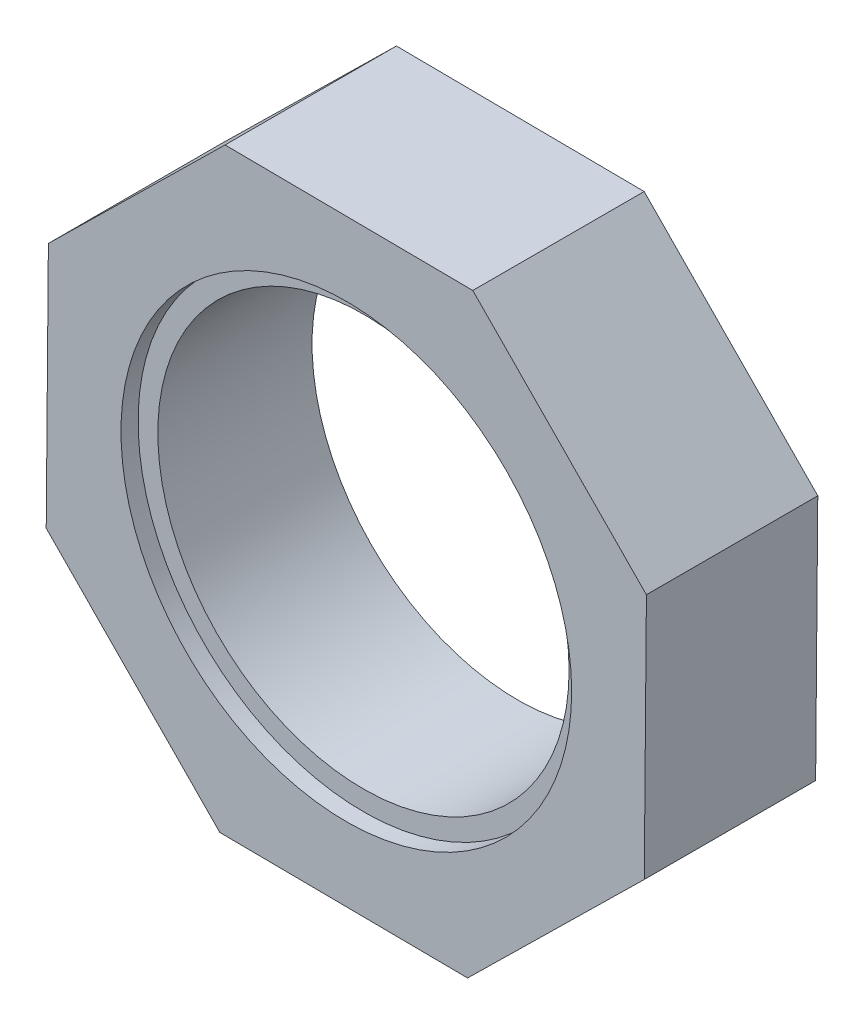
ISO-10303-21;
HEADER;
FILE_DESCRIPTION(('STEP AP214'),'2;1');
FILE_NAME('part.step','',(''),(''),'','','');
FILE_SCHEMA(('AUTOMOTIVE_DESIGN { 1 0 10303 214 1 1 1 1 }'));
ENDSEC;
DATA;
#1=APPLICATION_CONTEXT('core data for automotive mechanical design processes');
#2=APPLICATION_PROTOCOL_DEFINITION('international standard','automotive_design',2000,#1);
#3=PRODUCT_CONTEXT('',#1,'mechanical');
#4=PRODUCT('Part','Part','',(#3));
#5=PRODUCT_RELATED_PRODUCT_CATEGORY('part','',(#4));
#6=PRODUCT_DEFINITION_FORMATION('','',#4);
#7=PRODUCT_DEFINITION_CONTEXT('part definition',#1,'design');
#8=PRODUCT_DEFINITION('design','',#6,#7);
#9=PRODUCT_DEFINITION_SHAPE('','',#8);
#10=(LENGTH_UNIT() NAMED_UNIT(*) SI_UNIT(.MILLI.,.METRE.));
#11=(NAMED_UNIT(*) PLANE_ANGLE_UNIT() SI_UNIT($,.RADIAN.));
#12=(NAMED_UNIT(*) SI_UNIT($,.STERADIAN.) SOLID_ANGLE_UNIT());
#13=UNCERTAINTY_MEASURE_WITH_UNIT(LENGTH_MEASURE(1.E-05),#10,'distance_accuracy_value','');
#14=(GEOMETRIC_REPRESENTATION_CONTEXT(3) GLOBAL_UNCERTAINTY_ASSIGNED_CONTEXT((#13)) GLOBAL_UNIT_ASSIGNED_CONTEXT((#10,
#11,#12)) REPRESENTATION_CONTEXT('',''));
#15=CARTESIAN_POINT('',(0.,0.,0.));
#16=DIRECTION('',(0.,0.,1.));
#17=DIRECTION('',(1.,0.,0.));
#18=AXIS2_PLACEMENT_3D('',#15,#16,#17);
#19=CARTESIAN_POINT('',(0.,0.,0.));
#20=DIRECTION('',(0.,0.,1.));
#21=DIRECTION('',(1.,0.,0.));
#22=AXIS2_PLACEMENT_3D('',#19,#20,#21);
#23=CYLINDRICAL_SURFACE('',#22,12.);
#24=CARTESIAN_POINT('',(0.,0.,0.));
#25=DIRECTION('',(0.,0.,1.));
#26=DIRECTION('',(1.,0.,0.));
#27=AXIS2_PLACEMENT_3D('',#24,#25,#26);
#28=CIRCLE('',#27,12.);
#29=CARTESIAN_POINT('',(12.,0.,0.));
#30=VERTEX_POINT('',#29);
#31=EDGE_CURVE('E134',#30,#30,#28,.T.);
#32=ORIENTED_EDGE('',*,*,#31,.F.);
#33=EDGE_LOOP('',(#32));
#34=FACE_BOUND('',#33,.T.);
#35=CARTESIAN_POINT('',(0.,0.,9.));
#36=DIRECTION('',(0.,0.,1.));
#37=DIRECTION('',(1.,0.,0.));
#38=AXIS2_PLACEMENT_3D('',#35,#36,#37);
#39=CIRCLE('',#38,12.);
#40=CARTESIAN_POINT('',(12.,0.,9.));
#41=VERTEX_POINT('',#40);
#42=EDGE_CURVE('E36',#41,#41,#39,.F.);
#43=ORIENTED_EDGE('',*,*,#42,.F.);
#44=EDGE_LOOP('',(#43));
#45=FACE_BOUND('',#44,.T.);
#46=ADVANCED_FACE('F32',(#34,#45),#23,.F.);
#47=CARTESIAN_POINT('',(17.3862599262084,-7.38002948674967,10.));
#48=DIRECTION('',(-0.999961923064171,0.00872653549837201,0.));
#49=DIRECTION('',(-0.00872653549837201,-0.999961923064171,0.));
#50=AXIS2_PLACEMENT_3D('',#47,#48,#49);
#51=PLANE('',#50);
#52=DIRECTION('',(0.00872653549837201,0.999961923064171,0.));
#53=VECTOR('',#52,1.);
#54=CARTESIAN_POINT('',(17.3862599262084,-7.38002948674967,0.));
#55=LINE('',#54,#53);
#56=CARTESIAN_POINT('',(17.3862599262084,-7.38002948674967,0.));
#57=VERTEX_POINT('',#56);
#58=CARTESIAN_POINT('',(17.5124111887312,7.07547339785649,0.));
#59=VERTEX_POINT('',#58);
#60=EDGE_CURVE('E130',#57,#59,#55,.T.);
#61=ORIENTED_EDGE('',*,*,#60,.T.);
#62=DIRECTION('',(0.,0.,-1.));
#63=VECTOR('',#62,1.);
#64=CARTESIAN_POINT('',(17.5124111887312,7.07547339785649,10.));
#65=LINE('',#64,#63);
#66=CARTESIAN_POINT('',(17.5124111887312,7.07547339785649,10.));
#67=VERTEX_POINT('',#66);
#68=EDGE_CURVE('E11',#67,#59,#65,.T.);
#69=ORIENTED_EDGE('',*,*,#68,.F.);
#70=DIRECTION('',(0.00872653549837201,0.999961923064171,0.));
#71=VECTOR('',#70,1.);
#72=CARTESIAN_POINT('',(17.3862599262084,-7.38002948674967,10.));
#73=LINE('',#72,#71);
#74=CARTESIAN_POINT('',(17.3862599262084,-7.38002948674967,10.));
#75=VERTEX_POINT('',#74);
#76=EDGE_CURVE('E145',#75,#67,#73,.T.);
#77=ORIENTED_EDGE('',*,*,#76,.F.);
#78=DIRECTION('',(0.,0.,-1.));
#79=VECTOR('',#78,1.);
#80=CARTESIAN_POINT('',(17.3862599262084,-7.38002948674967,10.));
#81=LINE('',#80,#79);
#82=EDGE_CURVE('E126',#75,#57,#81,.T.);
#83=ORIENTED_EDGE('',*,*,#82,.T.);
#84=EDGE_LOOP('',(#61,#69,#77,#83));
#85=FACE_BOUND('',#84,.T.);
#86=ADVANCED_FACE('F34',(#85),#51,.F.);
#87=CARTESIAN_POINT('',(17.5124111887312,7.07547339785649,10.));
#88=DIRECTION('',(-0.71325044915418,-0.700909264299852,0.));
#89=DIRECTION('',(0.700909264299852,-0.71325044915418,0.));
#90=AXIS2_PLACEMENT_3D('',#87,#88,#89);
#91=PLANE('',#90);
#92=DIRECTION('',(-0.700909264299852,0.71325044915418,0.));
#93=VECTOR('',#92,1.);
#94=CARTESIAN_POINT('',(17.5124111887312,7.07547339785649,0.));
#95=LINE('',#94,#93);
#96=CARTESIAN_POINT('',(7.38002948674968,17.3862599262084,0.));
#97=VERTEX_POINT('',#96);
#98=EDGE_CURVE('E133',#59,#97,#95,.T.);
#99=ORIENTED_EDGE('',*,*,#98,.T.);
#100=DIRECTION('',(0.,0.,-1.));
#101=VECTOR('',#100,1.);
#102=CARTESIAN_POINT('',(7.38002948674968,17.3862599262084,10.));
#103=LINE('',#102,#101);
#104=CARTESIAN_POINT('',(7.38002948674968,17.3862599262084,10.));
#105=VERTEX_POINT('',#104);
#106=EDGE_CURVE('E42',#105,#97,#103,.T.);
#107=ORIENTED_EDGE('',*,*,#106,.F.);
#108=DIRECTION('',(-0.700909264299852,0.71325044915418,0.));
#109=VECTOR('',#108,1.);
#110=CARTESIAN_POINT('',(17.5124111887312,7.07547339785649,10.));
#111=LINE('',#110,#109);
#112=EDGE_CURVE('E93',#67,#105,#111,.T.);
#113=ORIENTED_EDGE('',*,*,#112,.F.);
#114=ORIENTED_EDGE('',*,*,#68,.T.);
#115=EDGE_LOOP('',(#99,#107,#113,#114));
#116=FACE_BOUND('',#115,.T.);
#117=ADVANCED_FACE('F199',(#116),#91,.F.);
#118=CARTESIAN_POINT('',(7.38002948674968,17.3862599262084,10.));
#119=DIRECTION('',(-0.00872653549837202,-0.999961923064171,0.));
#120=DIRECTION('',(0.999961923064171,-0.00872653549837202,0.));
#121=AXIS2_PLACEMENT_3D('',#118,#119,#120);
#122=PLANE('',#121);
#123=DIRECTION('',(-0.999961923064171,0.00872653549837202,0.));
#124=VECTOR('',#123,1.);
#125=CARTESIAN_POINT('',(7.38002948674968,17.3862599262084,0.));
#126=LINE('',#125,#124);
#127=CARTESIAN_POINT('',(-7.07547339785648,17.5124111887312,0.));
#128=VERTEX_POINT('',#127);
#129=EDGE_CURVE('E136',#97,#128,#126,.T.);
#130=ORIENTED_EDGE('',*,*,#129,.T.);
#131=DIRECTION('',(0.,0.,-1.));
#132=VECTOR('',#131,1.);
#133=CARTESIAN_POINT('',(-7.07547339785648,17.5124111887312,10.));
#134=LINE('',#133,#132);
#135=CARTESIAN_POINT('',(-7.07547339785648,17.5124111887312,10.));
#136=VERTEX_POINT('',#135);
#137=EDGE_CURVE('E152',#136,#128,#134,.T.);
#138=ORIENTED_EDGE('',*,*,#137,.F.);
#139=DIRECTION('',(-0.999961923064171,0.00872653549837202,0.));
#140=VECTOR('',#139,1.);
#141=CARTESIAN_POINT('',(7.38002948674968,17.3862599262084,10.));
#142=LINE('',#141,#140);
#143=EDGE_CURVE('E161',#105,#136,#142,.T.);
#144=ORIENTED_EDGE('',*,*,#143,.F.);
#145=ORIENTED_EDGE('',*,*,#106,.T.);
#146=EDGE_LOOP('',(#130,#138,#144,#145));
#147=FACE_BOUND('',#146,.T.);
#148=ADVANCED_FACE('F159',(#147),#122,.F.);
#149=CARTESIAN_POINT('',(-7.07547339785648,17.5124111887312,10.));
#150=DIRECTION('',(0.700909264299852,-0.713250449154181,0.));
#151=DIRECTION('',(0.713250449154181,0.700909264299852,0.));
#152=AXIS2_PLACEMENT_3D('',#149,#150,#151);
#153=PLANE('',#152);
#154=DIRECTION('',(-0.713250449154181,-0.700909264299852,0.));
#155=VECTOR('',#154,1.);
#156=CARTESIAN_POINT('',(-7.07547339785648,17.5124111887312,0.));
#157=LINE('',#156,#155);
#158=CARTESIAN_POINT('',(-17.3862599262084,7.38002948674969,0.));
#159=VERTEX_POINT('',#158);
#160=EDGE_CURVE('E138',#128,#159,#157,.T.);
#161=ORIENTED_EDGE('',*,*,#160,.T.);
#162=DIRECTION('',(0.,0.,-1.));
#163=VECTOR('',#162,1.);
#164=CARTESIAN_POINT('',(-17.3862599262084,7.38002948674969,10.));
#165=LINE('',#164,#163);
#166=CARTESIAN_POINT('',(-17.3862599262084,7.38002948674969,10.));
#167=VERTEX_POINT('',#166);
#168=EDGE_CURVE('E149',#167,#159,#165,.T.);
#169=ORIENTED_EDGE('',*,*,#168,.F.);
#170=DIRECTION('',(-0.713250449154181,-0.700909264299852,0.));
#171=VECTOR('',#170,1.);
#172=CARTESIAN_POINT('',(-7.07547339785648,17.5124111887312,10.));
#173=LINE('',#172,#171);
#174=EDGE_CURVE('E173',#136,#167,#173,.T.);
#175=ORIENTED_EDGE('',*,*,#174,.F.);
#176=ORIENTED_EDGE('',*,*,#137,.T.);
#177=EDGE_LOOP('',(#161,#169,#175,#176));
#178=FACE_BOUND('',#177,.T.);
#179=ADVANCED_FACE('F169',(#178),#153,.F.);
#180=CARTESIAN_POINT('',(-17.3862599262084,7.38002948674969,10.));
#181=DIRECTION('',(0.999961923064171,-0.00872653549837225,0.));
#182=DIRECTION('',(0.00872653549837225,0.999961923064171,0.));
#183=AXIS2_PLACEMENT_3D('',#180,#181,#182);
#184=PLANE('',#183);
#185=DIRECTION('',(-0.00872653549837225,-0.999961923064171,0.));
#186=VECTOR('',#185,1.);
#187=CARTESIAN_POINT('',(-17.3862599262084,7.38002948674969,0.));
#188=LINE('',#187,#186);
#189=CARTESIAN_POINT('',(-17.5124111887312,-7.07547339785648,0.));
#190=VERTEX_POINT('',#189);
#191=EDGE_CURVE('E140',#159,#190,#188,.T.);
#192=ORIENTED_EDGE('',*,*,#191,.T.);
#193=DIRECTION('',(0.,0.,-1.));
#194=VECTOR('',#193,1.);
#195=CARTESIAN_POINT('',(-17.5124111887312,-7.07547339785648,10.));
#196=LINE('',#195,#194);
#197=CARTESIAN_POINT('',(-17.5124111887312,-7.07547339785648,10.));
#198=VERTEX_POINT('',#197);
#199=EDGE_CURVE('E121',#198,#190,#196,.T.);
#200=ORIENTED_EDGE('',*,*,#199,.F.);
#201=DIRECTION('',(-0.00872653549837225,-0.999961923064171,0.));
#202=VECTOR('',#201,1.);
#203=CARTESIAN_POINT('',(-17.3862599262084,7.38002948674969,10.));
#204=LINE('',#203,#202);
#205=EDGE_CURVE('E112',#167,#198,#204,.T.);
#206=ORIENTED_EDGE('',*,*,#205,.F.);
#207=ORIENTED_EDGE('',*,*,#168,.T.);
#208=EDGE_LOOP('',(#192,#200,#206,#207));
#209=FACE_BOUND('',#208,.T.);
#210=ADVANCED_FACE('F172',(#209),#184,.F.);
#211=CARTESIAN_POINT('',(-17.5124111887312,-7.07547339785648,10.));
#212=DIRECTION('',(0.713250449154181,0.700909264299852,0.));
#213=DIRECTION('',(-0.700909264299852,0.713250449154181,0.));
#214=AXIS2_PLACEMENT_3D('',#211,#212,#213);
#215=PLANE('',#214);
#216=DIRECTION('',(0.700909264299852,-0.713250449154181,0.));
#217=VECTOR('',#216,1.);
#218=CARTESIAN_POINT('',(-17.5124111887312,-7.07547339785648,0.));
#219=LINE('',#218,#217);
#220=CARTESIAN_POINT('',(-7.38002948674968,-17.3862599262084,0.));
#221=VERTEX_POINT('',#220);
#222=EDGE_CURVE('E120',#190,#221,#219,.T.);
#223=ORIENTED_EDGE('',*,*,#222,.T.);
#224=DIRECTION('',(0.,0.,-1.));
#225=VECTOR('',#224,1.);
#226=CARTESIAN_POINT('',(-7.38002948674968,-17.3862599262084,10.));
#227=LINE('',#226,#225);
#228=CARTESIAN_POINT('',(-7.38002948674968,-17.3862599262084,10.));
#229=VERTEX_POINT('',#228);
#230=EDGE_CURVE('E117',#229,#221,#227,.T.);
#231=ORIENTED_EDGE('',*,*,#230,.F.);
#232=DIRECTION('',(0.700909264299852,-0.713250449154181,0.));
#233=VECTOR('',#232,1.);
#234=CARTESIAN_POINT('',(-17.5124111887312,-7.07547339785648,10.));
#235=LINE('',#234,#233);
#236=EDGE_CURVE('E106',#198,#229,#235,.T.);
#237=ORIENTED_EDGE('',*,*,#236,.F.);
#238=ORIENTED_EDGE('',*,*,#199,.T.);
#239=EDGE_LOOP('',(#223,#231,#237,#238));
#240=FACE_BOUND('',#239,.T.);
#241=ADVANCED_FACE('F118',(#240),#215,.F.);
#242=CARTESIAN_POINT('',(-7.38002948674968,-17.3862599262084,10.));
#243=DIRECTION('',(0.00872653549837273,0.999961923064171,0.));
#244=DIRECTION('',(-0.999961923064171,0.00872653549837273,0.));
#245=AXIS2_PLACEMENT_3D('',#242,#243,#244);
#246=PLANE('',#245);
#247=DIRECTION('',(0.999961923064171,-0.00872653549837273,0.));
#248=VECTOR('',#247,1.);
#249=CARTESIAN_POINT('',(-7.38002948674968,-17.3862599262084,0.));
#250=LINE('',#249,#248);
#251=CARTESIAN_POINT('',(7.07547339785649,-17.5124111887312,0.));
#252=VERTEX_POINT('',#251);
#253=EDGE_CURVE('E79',#221,#252,#250,.T.);
#254=ORIENTED_EDGE('',*,*,#253,.T.);
#255=DIRECTION('',(0.,0.,-1.));
#256=VECTOR('',#255,1.);
#257=CARTESIAN_POINT('',(7.07547339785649,-17.5124111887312,10.));
#258=LINE('',#257,#256);
#259=CARTESIAN_POINT('',(7.07547339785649,-17.5124111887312,10.));
#260=VERTEX_POINT('',#259);
#261=EDGE_CURVE('E122',#260,#252,#258,.T.);
#262=ORIENTED_EDGE('',*,*,#261,.F.);
#263=DIRECTION('',(0.999961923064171,-0.00872653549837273,0.));
#264=VECTOR('',#263,1.);
#265=CARTESIAN_POINT('',(-7.38002948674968,-17.3862599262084,10.));
#266=LINE('',#265,#264);
#267=EDGE_CURVE('E110',#229,#260,#266,.T.);
#268=ORIENTED_EDGE('',*,*,#267,.F.);
#269=ORIENTED_EDGE('',*,*,#230,.T.);
#270=EDGE_LOOP('',(#254,#262,#268,#269));
#271=FACE_BOUND('',#270,.T.);
#272=ADVANCED_FACE('F124',(#271),#246,.F.);
#273=CARTESIAN_POINT('',(7.07547339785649,-17.5124111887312,10.));
#274=DIRECTION('',(-0.700909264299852,0.71325044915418,0.));
#275=DIRECTION('',(-0.71325044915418,-0.700909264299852,0.));
#276=AXIS2_PLACEMENT_3D('',#273,#274,#275);
#277=PLANE('',#276);
#278=DIRECTION('',(0.71325044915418,0.700909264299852,0.));
#279=VECTOR('',#278,1.);
#280=CARTESIAN_POINT('',(7.07547339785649,-17.5124111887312,0.));
#281=LINE('',#280,#279);
#282=EDGE_CURVE('E85',#252,#57,#281,.T.);
#283=ORIENTED_EDGE('',*,*,#282,.T.);
#284=ORIENTED_EDGE('',*,*,#82,.F.);
#285=DIRECTION('',(0.71325044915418,0.700909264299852,0.));
#286=VECTOR('',#285,1.);
#287=CARTESIAN_POINT('',(7.07547339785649,-17.5124111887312,10.));
#288=LINE('',#287,#286);
#289=EDGE_CURVE('E50',#260,#75,#288,.T.);
#290=ORIENTED_EDGE('',*,*,#289,.F.);
#291=ORIENTED_EDGE('',*,*,#261,.T.);
#292=EDGE_LOOP('',(#283,#284,#290,#291));
#293=FACE_BOUND('',#292,.T.);
#294=ADVANCED_FACE('F208',(#293),#277,.F.);
#295=CARTESIAN_POINT('',(0.,0.,10.));
#296=DIRECTION('',(0.,0.,1.));
#297=DIRECTION('',(1.,0.,0.));
#298=AXIS2_PLACEMENT_3D('',#295,#296,#297);
#299=PLANE('',#298);
#300=CARTESIAN_POINT('',(0.,0.,10.));
#301=DIRECTION('',(0.,0.,1.));
#302=DIRECTION('',(1.,0.,0.));
#303=AXIS2_PLACEMENT_3D('',#300,#301,#302);
#304=CIRCLE('',#303,13.15);
#305=CARTESIAN_POINT('',(13.15,0.,10.));
#306=VERTEX_POINT('',#305);
#307=EDGE_CURVE('E181',#306,#306,#304,.T.);
#308=ORIENTED_EDGE('',*,*,#307,.F.);
#309=EDGE_LOOP('',(#308));
#310=FACE_BOUND('',#309,.T.);
#311=ORIENTED_EDGE('',*,*,#76,.T.);
#312=ORIENTED_EDGE('',*,*,#112,.T.);
#313=ORIENTED_EDGE('',*,*,#143,.T.);
#314=ORIENTED_EDGE('',*,*,#174,.T.);
#315=ORIENTED_EDGE('',*,*,#205,.T.);
#316=ORIENTED_EDGE('',*,*,#236,.T.);
#317=ORIENTED_EDGE('',*,*,#267,.T.);
#318=ORIENTED_EDGE('',*,*,#289,.T.);
#319=EDGE_LOOP('',(#311,#312,#313,#314,#315,#316,#317,#318));
#320=FACE_BOUND('',#319,.T.);
#321=ADVANCED_FACE('F108',(#310,#320),#299,.T.);
#322=CARTESIAN_POINT('',(0.,0.,0.));
#323=DIRECTION('',(0.,0.,1.));
#324=DIRECTION('',(1.,0.,0.));
#325=AXIS2_PLACEMENT_3D('',#322,#323,#324);
#326=PLANE('',#325);
#327=ORIENTED_EDGE('',*,*,#31,.T.);
#328=EDGE_LOOP('',(#327));
#329=FACE_BOUND('',#328,.T.);
#330=ORIENTED_EDGE('',*,*,#60,.F.);
#331=ORIENTED_EDGE('',*,*,#282,.F.);
#332=ORIENTED_EDGE('',*,*,#253,.F.);
#333=ORIENTED_EDGE('',*,*,#222,.F.);
#334=ORIENTED_EDGE('',*,*,#191,.F.);
#335=ORIENTED_EDGE('',*,*,#160,.F.);
#336=ORIENTED_EDGE('',*,*,#129,.F.);
#337=ORIENTED_EDGE('',*,*,#98,.F.);
#338=EDGE_LOOP('',(#330,#331,#332,#333,#334,#335,#336,#337));
#339=FACE_BOUND('',#338,.T.);
#340=ADVANCED_FACE('F165',(#329,#339),#326,.F.);
#341=CARTESIAN_POINT('',(0.,0.,9.));
#342=DIRECTION('',(0.,0.,1.));
#343=DIRECTION('',(1.,0.,0.));
#344=AXIS2_PLACEMENT_3D('',#341,#342,#343);
#345=PLANE('',#344);
#346=CARTESIAN_POINT('',(0.,0.,9.));
#347=DIRECTION('',(0.,0.,1.));
#348=DIRECTION('',(1.,0.,0.));
#349=AXIS2_PLACEMENT_3D('',#346,#347,#348);
#350=CIRCLE('',#349,13.15);
#351=CARTESIAN_POINT('',(13.15,0.,9.));
#352=VERTEX_POINT('',#351);
#353=EDGE_CURVE('E184',#352,#352,#350,.T.);
#354=ORIENTED_EDGE('',*,*,#353,.T.);
#355=EDGE_LOOP('',(#354));
#356=FACE_BOUND('',#355,.T.);
#357=ORIENTED_EDGE('',*,*,#42,.T.);
#358=EDGE_LOOP('',(#357));
#359=FACE_BOUND('',#358,.T.);
#360=ADVANCED_FACE('F191',(#356,#359),#345,.T.);
#361=CARTESIAN_POINT('',(0.,0.,9.));
#362=DIRECTION('',(0.,0.,1.));
#363=DIRECTION('',(1.,0.,0.));
#364=AXIS2_PLACEMENT_3D('',#361,#362,#363);
#365=CYLINDRICAL_SURFACE('',#364,13.15);
#366=ORIENTED_EDGE('',*,*,#353,.F.);
#367=EDGE_LOOP('',(#366));
#368=FACE_BOUND('',#367,.T.);
#369=ORIENTED_EDGE('',*,*,#307,.T.);
#370=EDGE_LOOP('',(#369));
#371=FACE_BOUND('',#370,.T.);
#372=ADVANCED_FACE('F204',(#368,#371),#365,.F.);
#373=CLOSED_SHELL('',(#46,#86,#117,#148,#179,#210,#241,#272,#294,#321,#340,#360,#372));
#374=MANIFOLD_SOLID_BREP('B2',#373);
#375=ADVANCED_BREP_SHAPE_REPRESENTATION('',(#18,#374),#14);
#376=SHAPE_DEFINITION_REPRESENTATION(#9,#375);
ENDSEC;
END-ISO-10303-21;
